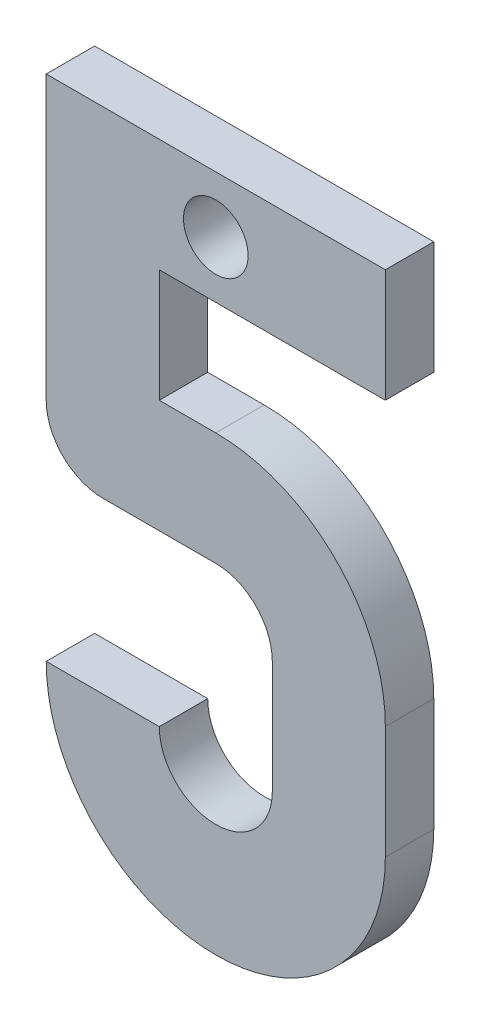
ISO-10303-21;
HEADER;
FILE_DESCRIPTION(('STEP AP214'),'2;1');
FILE_NAME('part.step','',(''),(''),'','','');
FILE_SCHEMA(('AUTOMOTIVE_DESIGN { 1 0 10303 214 1 1 1 1 }'));
ENDSEC;
DATA;
#1=APPLICATION_CONTEXT('core data for automotive mechanical design processes');
#2=APPLICATION_PROTOCOL_DEFINITION('international standard','automotive_design',2000,#1);
#3=PRODUCT_CONTEXT('',#1,'mechanical');
#4=PRODUCT('Part','Part','',(#3));
#5=PRODUCT_RELATED_PRODUCT_CATEGORY('part','',(#4));
#6=PRODUCT_DEFINITION_FORMATION('','',#4);
#7=PRODUCT_DEFINITION_CONTEXT('part definition',#1,'design');
#8=PRODUCT_DEFINITION('design','',#6,#7);
#9=PRODUCT_DEFINITION_SHAPE('','',#8);
#10=(LENGTH_UNIT() NAMED_UNIT(*) SI_UNIT(.MILLI.,.METRE.));
#11=(NAMED_UNIT(*) PLANE_ANGLE_UNIT() SI_UNIT($,.RADIAN.));
#12=(NAMED_UNIT(*) SI_UNIT($,.STERADIAN.) SOLID_ANGLE_UNIT());
#13=UNCERTAINTY_MEASURE_WITH_UNIT(LENGTH_MEASURE(1.E-05),#10,'distance_accuracy_value','');
#14=(GEOMETRIC_REPRESENTATION_CONTEXT(3) GLOBAL_UNCERTAINTY_ASSIGNED_CONTEXT((#13)) GLOBAL_UNIT_ASSIGNED_CONTEXT((#10,
#11,#12)) REPRESENTATION_CONTEXT('',''));
#15=CARTESIAN_POINT('',(0.,0.,0.));
#16=DIRECTION('',(0.,0.,1.));
#17=DIRECTION('',(1.,0.,0.));
#18=AXIS2_PLACEMENT_3D('',#15,#16,#17);
#19=CARTESIAN_POINT('',(3.19189119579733E-13,-15.6657283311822,3.));
#20=DIRECTION('',(1.,0.,0.));
#21=DIRECTION('',(0.,1.,0.));
#22=AXIS2_PLACEMENT_3D('',#19,#20,#21);
#23=PLANE('',#22);
#24=DIRECTION('',(0.,-1.,0.));
#25=VECTOR('',#24,1.);
#26=CARTESIAN_POINT('',(3.19189119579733E-13,-15.6657283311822,0.));
#27=LINE('',#26,#25);
#28=CARTESIAN_POINT('',(-1.47451495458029E-13,42.,0.));
#29=VERTEX_POINT('',#28);
#30=CARTESIAN_POINT('',(0.,24.5,0.));
#31=VERTEX_POINT('',#30);
#32=EDGE_CURVE('E178',#29,#31,#27,.T.);
#33=ORIENTED_EDGE('',*,*,#32,.T.);
#34=DIRECTION('',(0.,0.,-1.));
#35=VECTOR('',#34,1.);
#36=CARTESIAN_POINT('',(0.,24.5,3.));
#37=LINE('',#36,#35);
#38=CARTESIAN_POINT('',(0.,24.5,3.));
#39=VERTEX_POINT('',#38);
#40=EDGE_CURVE('E11',#39,#31,#37,.T.);
#41=ORIENTED_EDGE('',*,*,#40,.F.);
#42=DIRECTION('',(0.,-1.,0.));
#43=VECTOR('',#42,1.);
#44=CARTESIAN_POINT('',(3.19189119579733E-13,-15.6657283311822,3.));
#45=LINE('',#44,#43);
#46=CARTESIAN_POINT('',(-1.47451495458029E-13,42.,3.));
#47=VERTEX_POINT('',#46);
#48=EDGE_CURVE('E285',#47,#39,#45,.T.);
#49=ORIENTED_EDGE('',*,*,#48,.F.);
#50=DIRECTION('',(0.,0.,-1.));
#51=VECTOR('',#50,1.);
#52=CARTESIAN_POINT('',(-1.47451495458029E-13,42.,3.));
#53=LINE('',#52,#51);
#54=EDGE_CURVE('E174',#47,#29,#53,.T.);
#55=ORIENTED_EDGE('',*,*,#54,.T.);
#56=EDGE_LOOP('',(#33,#41,#49,#55));
#57=FACE_BOUND('',#56,.T.);
#58=ADVANCED_FACE('F34',(#57),#23,.F.);
#59=CARTESIAN_POINT('',(3.49999999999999,24.5,3.));
#60=DIRECTION('',(0.,0.,-1.));
#61=DIRECTION('',(-1.,0.,0.));
#62=AXIS2_PLACEMENT_3D('',#59,#60,#61);
#63=CYLINDRICAL_SURFACE('',#62,3.5);
#64=CARTESIAN_POINT('',(3.49999999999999,24.5,0.));
#65=DIRECTION('',(0.,0.,1.));
#66=DIRECTION('',(1.,0.,0.));
#67=AXIS2_PLACEMENT_3D('',#64,#65,#66);
#68=CIRCLE('',#67,3.5);
#69=CARTESIAN_POINT('',(3.49999999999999,21.,0.));
#70=VERTEX_POINT('',#69);
#71=EDGE_CURVE('E181',#31,#70,#68,.T.);
#72=ORIENTED_EDGE('',*,*,#71,.T.);
#73=DIRECTION('',(0.,0.,-1.));
#74=VECTOR('',#73,1.);
#75=CARTESIAN_POINT('',(3.49999999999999,21.,3.));
#76=LINE('',#75,#74);
#77=CARTESIAN_POINT('',(3.49999999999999,21.,3.));
#78=VERTEX_POINT('',#77);
#79=EDGE_CURVE('E43',#78,#70,#76,.T.);
#80=ORIENTED_EDGE('',*,*,#79,.F.);
#81=CARTESIAN_POINT('',(3.49999999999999,24.5,3.));
#82=DIRECTION('',(0.,0.,1.));
#83=DIRECTION('',(1.,0.,0.));
#84=AXIS2_PLACEMENT_3D('',#81,#82,#83);
#85=CIRCLE('',#84,3.5);
#86=EDGE_CURVE('E114',#39,#78,#85,.T.);
#87=ORIENTED_EDGE('',*,*,#86,.F.);
#88=ORIENTED_EDGE('',*,*,#40,.T.);
#89=EDGE_LOOP('',(#72,#80,#87,#88));
#90=FACE_BOUND('',#89,.T.);
#91=ADVANCED_FACE('F299',(#90),#63,.T.);
#92=CARTESIAN_POINT('',(10.4999999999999,21.,3.));
#93=DIRECTION('',(0.,1.,0.));
#94=DIRECTION('',(0.,0.,1.));
#95=AXIS2_PLACEMENT_3D('',#92,#93,#94);
#96=PLANE('',#95);
#97=DIRECTION('',(1.,0.,0.));
#98=VECTOR('',#97,1.);
#99=CARTESIAN_POINT('',(10.4999999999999,21.,0.));
#100=LINE('',#99,#98);
#101=CARTESIAN_POINT('',(10.5,21.,0.));
#102=VERTEX_POINT('',#101);
#103=EDGE_CURVE('E183',#70,#102,#100,.T.);
#104=ORIENTED_EDGE('',*,*,#103,.T.);
#105=DIRECTION('',(0.,0.,-1.));
#106=VECTOR('',#105,1.);
#107=CARTESIAN_POINT('',(10.5,21.,3.));
#108=LINE('',#107,#106);
#109=CARTESIAN_POINT('',(10.5,21.,3.));
#110=VERTEX_POINT('',#109);
#111=EDGE_CURVE('E236',#110,#102,#108,.T.);
#112=ORIENTED_EDGE('',*,*,#111,.F.);
#113=DIRECTION('',(1.,0.,0.));
#114=VECTOR('',#113,1.);
#115=CARTESIAN_POINT('',(10.4999999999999,21.,3.));
#116=LINE('',#115,#114);
#117=EDGE_CURVE('E243',#78,#110,#116,.T.);
#118=ORIENTED_EDGE('',*,*,#117,.F.);
#119=ORIENTED_EDGE('',*,*,#79,.T.);
#120=EDGE_LOOP('',(#104,#112,#118,#119));
#121=FACE_BOUND('',#120,.T.);
#122=ADVANCED_FACE('F241',(#121),#96,.F.);
#123=CARTESIAN_POINT('',(10.5,17.5,3.));
#124=DIRECTION('',(0.,0.,-1.));
#125=DIRECTION('',(-1.,0.,0.));
#126=AXIS2_PLACEMENT_3D('',#123,#124,#125);
#127=CYLINDRICAL_SURFACE('',#126,3.50000000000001);
#128=CARTESIAN_POINT('',(10.5,17.5,0.));
#129=DIRECTION('',(0.,0.,1.));
#130=DIRECTION('',(1.,0.,0.));
#131=AXIS2_PLACEMENT_3D('',#128,#129,#130);
#132=CIRCLE('',#131,3.50000000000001);
#133=CARTESIAN_POINT('',(14.,17.5,0.));
#134=VERTEX_POINT('',#133);
#135=EDGE_CURVE('E186',#134,#102,#132,.T.);
#136=ORIENTED_EDGE('',*,*,#135,.F.);
#137=DIRECTION('',(0.,0.,-1.));
#138=VECTOR('',#137,1.);
#139=CARTESIAN_POINT('',(14.,17.5,3.));
#140=LINE('',#139,#138);
#141=CARTESIAN_POINT('',(14.,17.5,3.));
#142=VERTEX_POINT('',#141);
#143=EDGE_CURVE('E234',#142,#134,#140,.T.);
#144=ORIENTED_EDGE('',*,*,#143,.F.);
#145=CARTESIAN_POINT('',(10.5,17.5,3.));
#146=DIRECTION('',(0.,0.,1.));
#147=DIRECTION('',(1.,0.,0.));
#148=AXIS2_PLACEMENT_3D('',#145,#146,#147);
#149=CIRCLE('',#148,3.50000000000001);
#150=EDGE_CURVE('E254',#142,#110,#149,.T.);
#151=ORIENTED_EDGE('',*,*,#150,.T.);
#152=ORIENTED_EDGE('',*,*,#111,.T.);
#153=EDGE_LOOP('',(#136,#144,#151,#152));
#154=FACE_BOUND('',#153,.T.);
#155=ADVANCED_FACE('F250',(#154),#127,.F.);
#156=CARTESIAN_POINT('',(14.,-15.6657283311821,3.));
#157=DIRECTION('',(1.,0.,0.));
#158=DIRECTION('',(0.,0.,-1.));
#159=AXIS2_PLACEMENT_3D('',#156,#157,#158);
#160=PLANE('',#159);
#161=DIRECTION('',(0.,-1.,0.));
#162=VECTOR('',#161,1.);
#163=CARTESIAN_POINT('',(14.,-15.6657283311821,0.));
#164=LINE('',#163,#162);
#165=CARTESIAN_POINT('',(14.,10.5,0.));
#166=VERTEX_POINT('',#165);
#167=EDGE_CURVE('E189',#134,#166,#164,.T.);
#168=ORIENTED_EDGE('',*,*,#167,.T.);
#169=DIRECTION('',(0.,0.,-1.));
#170=VECTOR('',#169,1.);
#171=CARTESIAN_POINT('',(14.,10.5,3.));
#172=LINE('',#171,#170);
#173=CARTESIAN_POINT('',(14.,10.5,3.));
#174=VERTEX_POINT('',#173);
#175=EDGE_CURVE('E232',#174,#166,#172,.T.);
#176=ORIENTED_EDGE('',*,*,#175,.F.);
#177=DIRECTION('',(0.,-1.,0.));
#178=VECTOR('',#177,1.);
#179=CARTESIAN_POINT('',(14.,-15.6657283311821,3.));
#180=LINE('',#179,#178);
#181=EDGE_CURVE('E255',#142,#174,#180,.T.);
#182=ORIENTED_EDGE('',*,*,#181,.F.);
#183=ORIENTED_EDGE('',*,*,#143,.T.);
#184=EDGE_LOOP('',(#168,#176,#182,#183));
#185=FACE_BOUND('',#184,.T.);
#186=ADVANCED_FACE('F309',(#185),#160,.F.);
#187=CARTESIAN_POINT('',(10.5,10.5,3.));
#188=DIRECTION('',(0.,0.,-1.));
#189=DIRECTION('',(-1.,0.,0.));
#190=AXIS2_PLACEMENT_3D('',#187,#188,#189);
#191=CYLINDRICAL_SURFACE('',#190,3.5);
#192=CARTESIAN_POINT('',(10.5,10.5,0.));
#193=DIRECTION('',(0.,0.,1.));
#194=DIRECTION('',(1.,0.,0.));
#195=AXIS2_PLACEMENT_3D('',#192,#193,#194);
#196=CIRCLE('',#195,3.5);
#197=CARTESIAN_POINT('',(7.,10.5,0.));
#198=VERTEX_POINT('',#197);
#199=EDGE_CURVE('E192',#198,#166,#196,.T.);
#200=ORIENTED_EDGE('',*,*,#199,.F.);
#201=DIRECTION('',(0.,0.,-1.));
#202=VECTOR('',#201,1.);
#203=CARTESIAN_POINT('',(7.,10.5,3.));
#204=LINE('',#203,#202);
#205=CARTESIAN_POINT('',(7.,10.5,3.));
#206=VERTEX_POINT('',#205);
#207=EDGE_CURVE('E230',#206,#198,#204,.T.);
#208=ORIENTED_EDGE('',*,*,#207,.F.);
#209=CARTESIAN_POINT('',(10.5,10.5,3.));
#210=DIRECTION('',(0.,0.,1.));
#211=DIRECTION('',(1.,0.,0.));
#212=AXIS2_PLACEMENT_3D('',#209,#210,#211);
#213=CIRCLE('',#212,3.5);
#214=EDGE_CURVE('E257',#206,#174,#213,.T.);
#215=ORIENTED_EDGE('',*,*,#214,.T.);
#216=ORIENTED_EDGE('',*,*,#175,.T.);
#217=EDGE_LOOP('',(#200,#208,#215,#216));
#218=FACE_BOUND('',#217,.T.);
#219=ADVANCED_FACE('F312',(#218),#191,.F.);
#220=CARTESIAN_POINT('',(10.4999999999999,10.5,3.));
#221=DIRECTION('',(0.,-1.,0.));
#222=DIRECTION('',(0.,0.,-1.));
#223=AXIS2_PLACEMENT_3D('',#220,#221,#222);
#224=PLANE('',#223);
#225=DIRECTION('',(-1.,0.,0.));
#226=VECTOR('',#225,1.);
#227=CARTESIAN_POINT('',(10.4999999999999,10.5,0.));
#228=LINE('',#227,#226);
#229=CARTESIAN_POINT('',(0.,10.5,0.));
#230=VERTEX_POINT('',#229);
#231=EDGE_CURVE('E195',#198,#230,#228,.T.);
#232=ORIENTED_EDGE('',*,*,#231,.T.);
#233=DIRECTION('',(0.,0.,-1.));
#234=VECTOR('',#233,1.);
#235=CARTESIAN_POINT('',(0.,10.5,3.));
#236=LINE('',#235,#234);
#237=CARTESIAN_POINT('',(0.,10.5,3.));
#238=VERTEX_POINT('',#237);
#239=EDGE_CURVE('E227',#238,#230,#236,.T.);
#240=ORIENTED_EDGE('',*,*,#239,.F.);
#241=DIRECTION('',(-1.,0.,0.));
#242=VECTOR('',#241,1.);
#243=CARTESIAN_POINT('',(10.4999999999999,10.5,3.));
#244=LINE('',#243,#242);
#245=EDGE_CURVE('E264',#206,#238,#244,.T.);
#246=ORIENTED_EDGE('',*,*,#245,.F.);
#247=ORIENTED_EDGE('',*,*,#207,.T.);
#248=EDGE_LOOP('',(#232,#240,#246,#247));
#249=FACE_BOUND('',#248,.T.);
#250=ADVANCED_FACE('F316',(#249),#224,.F.);
#251=CARTESIAN_POINT('',(10.5,10.5,3.));
#252=DIRECTION('',(0.,0.,-1.));
#253=DIRECTION('',(-1.,0.,0.));
#254=AXIS2_PLACEMENT_3D('',#251,#252,#253);
#255=CYLINDRICAL_SURFACE('',#254,10.5);
#256=CARTESIAN_POINT('',(10.5,10.5,0.));
#257=DIRECTION('',(0.,0.,1.));
#258=DIRECTION('',(1.,0.,0.));
#259=AXIS2_PLACEMENT_3D('',#256,#257,#258);
#260=CIRCLE('',#259,10.5);
#261=CARTESIAN_POINT('',(21.,10.5,0.));
#262=VERTEX_POINT('',#261);
#263=EDGE_CURVE('E197',#230,#262,#260,.T.);
#264=ORIENTED_EDGE('',*,*,#263,.T.);
#265=DIRECTION('',(0.,0.,-1.));
#266=VECTOR('',#265,1.);
#267=CARTESIAN_POINT('',(21.,10.5,3.));
#268=LINE('',#267,#266);
#269=CARTESIAN_POINT('',(21.,10.5,3.));
#270=VERTEX_POINT('',#269);
#271=EDGE_CURVE('E225',#270,#262,#268,.T.);
#272=ORIENTED_EDGE('',*,*,#271,.F.);
#273=CARTESIAN_POINT('',(10.5,10.5,3.));
#274=DIRECTION('',(0.,0.,1.));
#275=DIRECTION('',(1.,0.,0.));
#276=AXIS2_PLACEMENT_3D('',#273,#274,#275);
#277=CIRCLE('',#276,10.5);
#278=EDGE_CURVE('E266',#238,#270,#277,.T.);
#279=ORIENTED_EDGE('',*,*,#278,.F.);
#280=ORIENTED_EDGE('',*,*,#239,.T.);
#281=EDGE_LOOP('',(#264,#272,#279,#280));
#282=FACE_BOUND('',#281,.T.);
#283=ADVANCED_FACE('F320',(#282),#255,.T.);
#284=CARTESIAN_POINT('',(21.,-15.6657283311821,3.));
#285=DIRECTION('',(1.,0.,0.));
#286=DIRECTION('',(0.,1.,0.));
#287=AXIS2_PLACEMENT_3D('',#284,#285,#286);
#288=PLANE('',#287);
#289=DIRECTION('',(0.,-1.,0.));
#290=VECTOR('',#289,1.);
#291=CARTESIAN_POINT('',(21.,-15.6657283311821,0.));
#292=LINE('',#291,#290);
#293=CARTESIAN_POINT('',(21.,17.5,0.));
#294=VERTEX_POINT('',#293);
#295=EDGE_CURVE('E200',#294,#262,#292,.T.);
#296=ORIENTED_EDGE('',*,*,#295,.F.);
#297=DIRECTION('',(0.,0.,-1.));
#298=VECTOR('',#297,1.);
#299=CARTESIAN_POINT('',(21.,17.5,3.));
#300=LINE('',#299,#298);
#301=CARTESIAN_POINT('',(21.,17.5,3.));
#302=VERTEX_POINT('',#301);
#303=EDGE_CURVE('E223',#302,#294,#300,.T.);
#304=ORIENTED_EDGE('',*,*,#303,.F.);
#305=DIRECTION('',(0.,-1.,0.));
#306=VECTOR('',#305,1.);
#307=CARTESIAN_POINT('',(21.,-15.6657283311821,3.));
#308=LINE('',#307,#306);
#309=EDGE_CURVE('E268',#302,#270,#308,.T.);
#310=ORIENTED_EDGE('',*,*,#309,.T.);
#311=ORIENTED_EDGE('',*,*,#271,.T.);
#312=EDGE_LOOP('',(#296,#304,#310,#311));
#313=FACE_BOUND('',#312,.T.);
#314=ADVANCED_FACE('F324',(#313),#288,.T.);
#315=CARTESIAN_POINT('',(10.5,17.5,3.));
#316=DIRECTION('',(0.,0.,-1.));
#317=DIRECTION('',(-1.,0.,0.));
#318=AXIS2_PLACEMENT_3D('',#315,#316,#317);
#319=CYLINDRICAL_SURFACE('',#318,10.5);
#320=CARTESIAN_POINT('',(10.5,17.5,0.));
#321=DIRECTION('',(0.,0.,1.));
#322=DIRECTION('',(1.,0.,0.));
#323=AXIS2_PLACEMENT_3D('',#320,#321,#322);
#324=CIRCLE('',#323,10.5);
#325=CARTESIAN_POINT('',(10.5,28.,0.));
#326=VERTEX_POINT('',#325);
#327=EDGE_CURVE('E203',#294,#326,#324,.T.);
#328=ORIENTED_EDGE('',*,*,#327,.T.);
#329=DIRECTION('',(0.,0.,-1.));
#330=VECTOR('',#329,1.);
#331=CARTESIAN_POINT('',(10.5,28.,3.));
#332=LINE('',#331,#330);
#333=CARTESIAN_POINT('',(10.5,28.,3.));
#334=VERTEX_POINT('',#333);
#335=EDGE_CURVE('E221',#334,#326,#332,.T.);
#336=ORIENTED_EDGE('',*,*,#335,.F.);
#337=CARTESIAN_POINT('',(10.5,17.5,3.));
#338=DIRECTION('',(0.,0.,1.));
#339=DIRECTION('',(1.,0.,0.));
#340=AXIS2_PLACEMENT_3D('',#337,#338,#339);
#341=CIRCLE('',#340,10.5);
#342=EDGE_CURVE('E271',#302,#334,#341,.T.);
#343=ORIENTED_EDGE('',*,*,#342,.F.);
#344=ORIENTED_EDGE('',*,*,#303,.T.);
#345=EDGE_LOOP('',(#328,#336,#343,#344));
#346=FACE_BOUND('',#345,.T.);
#347=ADVANCED_FACE('F328',(#346),#319,.T.);
#348=CARTESIAN_POINT('',(10.4999999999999,28.,3.));
#349=DIRECTION('',(0.,1.,0.));
#350=DIRECTION('',(0.,0.,1.));
#351=AXIS2_PLACEMENT_3D('',#348,#349,#350);
#352=PLANE('',#351);
#353=DIRECTION('',(1.,0.,0.));
#354=VECTOR('',#353,1.);
#355=CARTESIAN_POINT('',(10.4999999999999,28.,0.));
#356=LINE('',#355,#354);
#357=CARTESIAN_POINT('',(7.,28.,0.));
#358=VERTEX_POINT('',#357);
#359=EDGE_CURVE('E206',#358,#326,#356,.T.);
#360=ORIENTED_EDGE('',*,*,#359,.F.);
#361=DIRECTION('',(0.,0.,-1.));
#362=VECTOR('',#361,1.);
#363=CARTESIAN_POINT('',(7.,28.,3.));
#364=LINE('',#363,#362);
#365=CARTESIAN_POINT('',(7.,28.,3.));
#366=VERTEX_POINT('',#365);
#367=EDGE_CURVE('E219',#366,#358,#364,.T.);
#368=ORIENTED_EDGE('',*,*,#367,.F.);
#369=DIRECTION('',(1.,0.,0.));
#370=VECTOR('',#369,1.);
#371=CARTESIAN_POINT('',(10.4999999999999,28.,3.));
#372=LINE('',#371,#370);
#373=EDGE_CURVE('E169',#366,#334,#372,.T.);
#374=ORIENTED_EDGE('',*,*,#373,.T.);
#375=ORIENTED_EDGE('',*,*,#335,.T.);
#376=EDGE_LOOP('',(#360,#368,#374,#375));
#377=FACE_BOUND('',#376,.T.);
#378=ADVANCED_FACE('F275',(#377),#352,.T.);
#379=CARTESIAN_POINT('',(7.,-15.6657283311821,3.));
#380=DIRECTION('',(1.,0.,0.));
#381=DIRECTION('',(0.,0.,-1.));
#382=AXIS2_PLACEMENT_3D('',#379,#380,#381);
#383=PLANE('',#382);
#384=DIRECTION('',(0.,-1.,0.));
#385=VECTOR('',#384,1.);
#386=CARTESIAN_POINT('',(7.,-15.6657283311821,0.));
#387=LINE('',#386,#385);
#388=CARTESIAN_POINT('',(7.,35.,0.));
#389=VERTEX_POINT('',#388);
#390=EDGE_CURVE('E209',#389,#358,#387,.T.);
#391=ORIENTED_EDGE('',*,*,#390,.F.);
#392=DIRECTION('',(0.,0.,-1.));
#393=VECTOR('',#392,1.);
#394=CARTESIAN_POINT('',(7.,35.,3.));
#395=LINE('',#394,#393);
#396=CARTESIAN_POINT('',(7.,35.,3.));
#397=VERTEX_POINT('',#396);
#398=EDGE_CURVE('E157',#397,#389,#395,.T.);
#399=ORIENTED_EDGE('',*,*,#398,.F.);
#400=DIRECTION('',(0.,-1.,0.));
#401=VECTOR('',#400,1.);
#402=CARTESIAN_POINT('',(7.,-15.6657283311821,3.));
#403=LINE('',#402,#401);
#404=EDGE_CURVE('E167',#397,#366,#403,.T.);
#405=ORIENTED_EDGE('',*,*,#404,.T.);
#406=ORIENTED_EDGE('',*,*,#367,.T.);
#407=EDGE_LOOP('',(#391,#399,#405,#406));
#408=FACE_BOUND('',#407,.T.);
#409=ADVANCED_FACE('F281',(#408),#383,.T.);
#410=CARTESIAN_POINT('',(10.4999999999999,35.,3.));
#411=DIRECTION('',(0.,-1.,0.));
#412=DIRECTION('',(0.,0.,-1.));
#413=AXIS2_PLACEMENT_3D('',#410,#411,#412);
#414=PLANE('',#413);
#415=DIRECTION('',(-1.,0.,0.));
#416=VECTOR('',#415,1.);
#417=CARTESIAN_POINT('',(10.4999999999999,35.,0.));
#418=LINE('',#417,#416);
#419=CARTESIAN_POINT('',(21.,35.,0.));
#420=VERTEX_POINT('',#419);
#421=EDGE_CURVE('E156',#420,#389,#418,.T.);
#422=ORIENTED_EDGE('',*,*,#421,.F.);
#423=DIRECTION('',(0.,0.,-1.));
#424=VECTOR('',#423,1.);
#425=CARTESIAN_POINT('',(21.,35.,3.));
#426=LINE('',#425,#424);
#427=CARTESIAN_POINT('',(21.,35.,3.));
#428=VERTEX_POINT('',#427);
#429=EDGE_CURVE('E150',#428,#420,#426,.T.);
#430=ORIENTED_EDGE('',*,*,#429,.F.);
#431=DIRECTION('',(-1.,0.,0.));
#432=VECTOR('',#431,1.);
#433=CARTESIAN_POINT('',(10.4999999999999,35.,3.));
#434=LINE('',#433,#432);
#435=EDGE_CURVE('E154',#428,#397,#434,.T.);
#436=ORIENTED_EDGE('',*,*,#435,.T.);
#437=ORIENTED_EDGE('',*,*,#398,.T.);
#438=EDGE_LOOP('',(#422,#430,#436,#437));
#439=FACE_BOUND('',#438,.T.);
#440=ADVANCED_FACE('F152',(#439),#414,.T.);
#441=CARTESIAN_POINT('',(21.0000000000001,-15.6657283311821,3.));
#442=DIRECTION('',(-1.,0.,0.));
#443=DIRECTION('',(0.,-1.,0.));
#444=AXIS2_PLACEMENT_3D('',#441,#442,#443);
#445=PLANE('',#444);
#446=DIRECTION('',(0.,1.,0.));
#447=VECTOR('',#446,1.);
#448=CARTESIAN_POINT('',(21.0000000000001,-15.6657283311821,0.));
#449=LINE('',#448,#447);
#450=CARTESIAN_POINT('',(21.,42.,0.));
#451=VERTEX_POINT('',#450);
#452=EDGE_CURVE('E100',#420,#451,#449,.T.);
#453=ORIENTED_EDGE('',*,*,#452,.T.);
#454=DIRECTION('',(0.,0.,-1.));
#455=VECTOR('',#454,1.);
#456=CARTESIAN_POINT('',(21.,42.,3.));
#457=LINE('',#456,#455);
#458=CARTESIAN_POINT('',(21.,42.,3.));
#459=VERTEX_POINT('',#458);
#460=EDGE_CURVE('E158',#459,#451,#457,.T.);
#461=ORIENTED_EDGE('',*,*,#460,.F.);
#462=DIRECTION('',(0.,1.,0.));
#463=VECTOR('',#462,1.);
#464=CARTESIAN_POINT('',(21.0000000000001,-15.6657283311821,3.));
#465=LINE('',#464,#463);
#466=EDGE_CURVE('E160',#428,#459,#465,.T.);
#467=ORIENTED_EDGE('',*,*,#466,.F.);
#468=ORIENTED_EDGE('',*,*,#429,.T.);
#469=EDGE_LOOP('',(#453,#461,#467,#468));
#470=FACE_BOUND('',#469,.T.);
#471=ADVANCED_FACE('F161',(#470),#445,.F.);
#472=CARTESIAN_POINT('',(10.5,38.5,3.));
#473=DIRECTION('',(0.,0.,-1.));
#474=DIRECTION('',(-1.,0.,0.));
#475=AXIS2_PLACEMENT_3D('',#472,#473,#474);
#476=CYLINDRICAL_SURFACE('',#475,2.);
#477=CARTESIAN_POINT('',(10.5,38.5,3.));
#478=DIRECTION('',(0.,0.,1.));
#479=DIRECTION('',(1.,0.,0.));
#480=AXIS2_PLACEMENT_3D('',#477,#478,#479);
#481=CIRCLE('',#480,2.);
#482=CARTESIAN_POINT('',(12.5,38.5,3.));
#483=VERTEX_POINT('',#482);
#484=EDGE_CURVE('E215',#483,#483,#481,.T.);
#485=ORIENTED_EDGE('',*,*,#484,.T.);
#486=EDGE_LOOP('',(#485));
#487=FACE_BOUND('',#486,.T.);
#488=CARTESIAN_POINT('',(10.5,38.5,0.));
#489=DIRECTION('',(0.,0.,1.));
#490=DIRECTION('',(1.,0.,0.));
#491=AXIS2_PLACEMENT_3D('',#488,#489,#490);
#492=CIRCLE('',#491,2.);
#493=CARTESIAN_POINT('',(12.5,38.5,0.));
#494=VERTEX_POINT('',#493);
#495=EDGE_CURVE('E175',#494,#494,#492,.T.);
#496=ORIENTED_EDGE('',*,*,#495,.F.);
#497=EDGE_LOOP('',(#496));
#498=FACE_BOUND('',#497,.T.);
#499=ADVANCED_FACE('F36',(#487,#498),#476,.F.);
#500=CARTESIAN_POINT('',(10.4999999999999,42.,3.));
#501=DIRECTION('',(0.,-1.,0.));
#502=DIRECTION('',(0.,0.,-1.));
#503=AXIS2_PLACEMENT_3D('',#500,#501,#502);
#504=PLANE('',#503);
#505=DIRECTION('',(-1.,0.,0.));
#506=VECTOR('',#505,1.);
#507=CARTESIAN_POINT('',(10.4999999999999,42.,0.));
#508=LINE('',#507,#506);
#509=EDGE_CURVE('E106',#451,#29,#508,.T.);
#510=ORIENTED_EDGE('',*,*,#509,.T.);
#511=ORIENTED_EDGE('',*,*,#54,.F.);
#512=DIRECTION('',(-1.,0.,0.));
#513=VECTOR('',#512,1.);
#514=CARTESIAN_POINT('',(10.4999999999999,42.,3.));
#515=LINE('',#514,#513);
#516=EDGE_CURVE('E51',#459,#47,#515,.T.);
#517=ORIENTED_EDGE('',*,*,#516,.F.);
#518=ORIENTED_EDGE('',*,*,#460,.T.);
#519=EDGE_LOOP('',(#510,#511,#517,#518));
#520=FACE_BOUND('',#519,.T.);
#521=ADVANCED_FACE('F286',(#520),#504,.F.);
#522=CARTESIAN_POINT('',(10.4999999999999,-15.6657283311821,3.));
#523=DIRECTION('',(0.,0.,1.));
#524=DIRECTION('',(1.,0.,0.));
#525=AXIS2_PLACEMENT_3D('',#522,#523,#524);
#526=PLANE('',#525);
#527=ORIENTED_EDGE('',*,*,#484,.F.);
#528=EDGE_LOOP('',(#527));
#529=FACE_BOUND('',#528,.T.);
#530=ORIENTED_EDGE('',*,*,#48,.T.);
#531=ORIENTED_EDGE('',*,*,#86,.T.);
#532=ORIENTED_EDGE('',*,*,#117,.T.);
#533=ORIENTED_EDGE('',*,*,#150,.F.);
#534=ORIENTED_EDGE('',*,*,#181,.T.);
#535=ORIENTED_EDGE('',*,*,#214,.F.);
#536=ORIENTED_EDGE('',*,*,#245,.T.);
#537=ORIENTED_EDGE('',*,*,#278,.T.);
#538=ORIENTED_EDGE('',*,*,#309,.F.);
#539=ORIENTED_EDGE('',*,*,#342,.T.);
#540=ORIENTED_EDGE('',*,*,#373,.F.);
#541=ORIENTED_EDGE('',*,*,#404,.F.);
#542=ORIENTED_EDGE('',*,*,#435,.F.);
#543=ORIENTED_EDGE('',*,*,#466,.T.);
#544=ORIENTED_EDGE('',*,*,#516,.T.);
#545=EDGE_LOOP('',(#530,#531,#532,#533,#534,#535,#536,#537,#538,#539,#540,#541,#542,#543,#544));
#546=FACE_BOUND('',#545,.T.);
#547=ADVANCED_FACE('F164',(#529,#546),#526,.T.);
#548=CARTESIAN_POINT('',(10.4999999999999,-15.6657283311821,0.));
#549=DIRECTION('',(0.,0.,1.));
#550=DIRECTION('',(1.,0.,0.));
#551=AXIS2_PLACEMENT_3D('',#548,#549,#550);
#552=PLANE('',#551);
#553=ORIENTED_EDGE('',*,*,#495,.T.);
#554=EDGE_LOOP('',(#553));
#555=FACE_BOUND('',#554,.T.);
#556=ORIENTED_EDGE('',*,*,#32,.F.);
#557=ORIENTED_EDGE('',*,*,#509,.F.);
#558=ORIENTED_EDGE('',*,*,#452,.F.);
#559=ORIENTED_EDGE('',*,*,#421,.T.);
#560=ORIENTED_EDGE('',*,*,#390,.T.);
#561=ORIENTED_EDGE('',*,*,#359,.T.);
#562=ORIENTED_EDGE('',*,*,#327,.F.);
#563=ORIENTED_EDGE('',*,*,#295,.T.);
#564=ORIENTED_EDGE('',*,*,#263,.F.);
#565=ORIENTED_EDGE('',*,*,#231,.F.);
#566=ORIENTED_EDGE('',*,*,#199,.T.);
#567=ORIENTED_EDGE('',*,*,#167,.F.);
#568=ORIENTED_EDGE('',*,*,#135,.T.);
#569=ORIENTED_EDGE('',*,*,#103,.F.);
#570=ORIENTED_EDGE('',*,*,#71,.F.);
#571=EDGE_LOOP('',(#556,#557,#558,#559,#560,#561,#562,#563,#564,#565,#566,#567,#568,#569,#570));
#572=FACE_BOUND('',#571,.T.);
#573=ADVANCED_FACE('F246',(#555,#572),#552,.F.);
#574=CLOSED_SHELL('',(#58,#91,#122,#155,#186,#219,#250,#283,#314,#347,#378,#409,#440,#471,#499,
#521,#547,#573));
#575=MANIFOLD_SOLID_BREP('B2',#574);
#576=ADVANCED_BREP_SHAPE_REPRESENTATION('',(#18,#575),#14);
#577=SHAPE_DEFINITION_REPRESENTATION(#9,#576);
ENDSEC;
END-ISO-10303-21;
